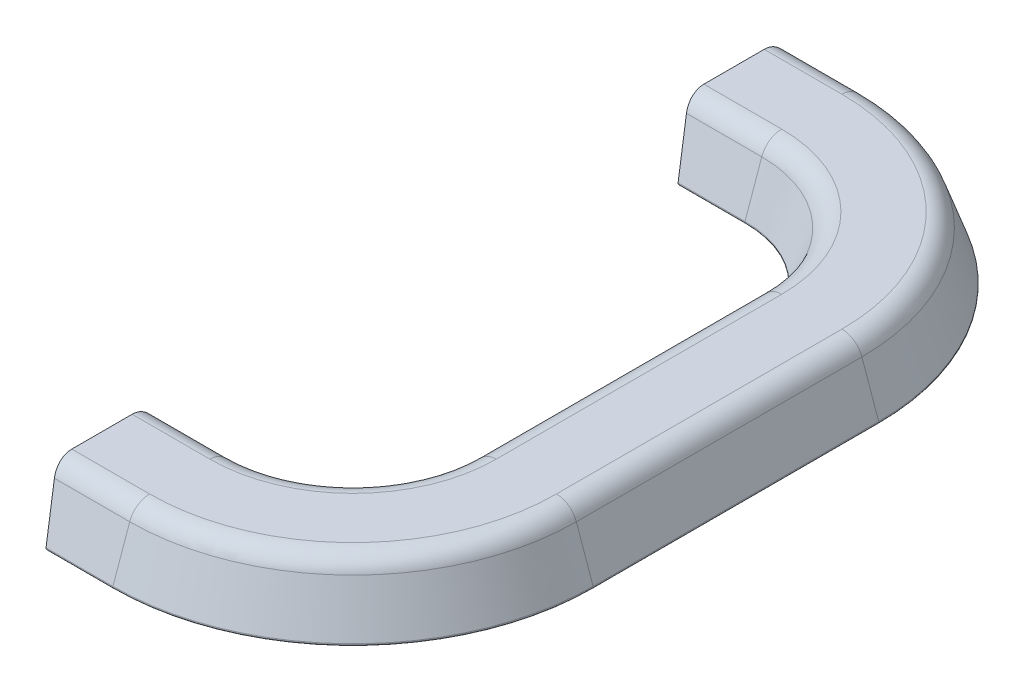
from build123d import *

# Parameters (mm, degrees)
FILLET1_R      = 5.08
SHELL1_T       = -2.54
EXTRUDE1_REACH = 121.17
FILLET2_R      = 0.396875


with BuildPart() as part:
    # Sweep1: sweep along a path in Sketch2
    with BuildLine(Plane(origin=(0, 0, 0), x_dir=(1, 0, 0), z_dir=(0, 1, 0))) as sweep1_path:
        Line((0, -59.724007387), (18.701415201, -59.724007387))
        ThreePointArc((18.701415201, -59.724007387), (36.661927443, -52.284519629), (44.101415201, -34.324007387))
        Line((44.101415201, -34.324007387), (44.101415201, 34.324007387))
        ThreePointArc((44.101415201, 34.324007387), (36.661927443, 52.284519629), (18.701415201, 59.724007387))
        Line((18.701415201, 59.724007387), (0, 59.724007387))
    # Sketch1 → Sweep1 (sweep)
    with BuildSketch(Plane(origin=(0, 0, 0), x_dir=(0, 0, -1), z_dir=(1, 0, 0))):
        Polygon((-92.230378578, 0), (-59.724007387, 0), (-65.134510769, 15.350234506), (-86.819875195, 15.350234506), align=None)
    sweep(path=sweep1_path.line)

    # SurfaceCut1
    split(bisect_by=Plane(origin=(2.625044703, 0.462866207, 0), x_dir=(0, 0, 1), z_dir=(-0.9848077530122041, -0.17364817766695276, 0)), keep=Keep.BOTTOM)

    # Fillet1
    fillet1_edges = [part.edges().sort_by_distance(p)[0] for p in [
        (55.821599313, 15.350234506, 71.444191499),
        (40.487731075, 15.350234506, 56.11032326),
        (71.19728301, 15.350234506, 0),
        (49.511918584, 15.350234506, 0),
        (55.821599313, 15.350234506, -71.444191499),
        (40.487731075, 15.350234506, -56.11032326),
        (9.350707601, 15.350234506, -86.819875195),
        (9.350707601, 15.350234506, -65.134510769),
        (9.350707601, 15.350234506, 86.819875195),
        (9.350707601, 15.350234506, 65.134510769),
    ]]
    fillet(fillet1_edges, radius=FILLET1_R)

    # Shell1
    shell1_openings = [part.faces().sort_by_distance(p)[0] for p in [
        (45.698397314, 0, 0),
        (1.458578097, 7.07822706, -75.977192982),
        (1.458578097, 7.07822706, 75.977192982),
    ]]
    offset(amount=SHELL1_T, openings=shell1_openings, kind=Kind.INTERSECTION)

    # Sketch4 → Extrude1 (add, up to next)
    with BuildSketch(Plane(origin=(2.625044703, 0.462866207, 0), x_dir=(0, 0, 1), z_dir=(-0.9848077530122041, -0.1736481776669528, 0)), mode=Mode.PRIVATE) as extrude1_sk1:
        with BuildLine():
            Line((-78.948196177, 12.537846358), (-78.59959728, 8.553342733))
            ThreePointArc((-78.59959728, 8.553342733), (-75.977192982, 6.150351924), (-73.354788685, 8.553342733))
            Line((-73.354788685, 8.553342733), (-73.006189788, 12.537846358))
            Line((-73.006189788, 12.537846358), (-78.948196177, 12.537846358))
        make_face()
    extrude1_tool1 = extrude(extrude1_sk1.sketch, amount=-EXTRUDE1_REACH, mode=Mode.PRIVATE) - part.part
    extrude1 = extrude1_tool1.solids().sort_by_distance((0.946808, 9.980618, -75.977193))[0]
    add(extrude1)

    # Sketch5 → 7_64 _0.10938_ Diameter Hole1 (revolve, cut)
    with BuildSketch(Plane(origin=(1.099932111, 9.112209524, -75.977192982), x_dir=(0.1736481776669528, -0.9848077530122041, 0), z_dir=(0, 0, 1))):
        Polygon((0, 0), (0, 13.534671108), (1.389126, 12.7), (1.389126, 0), align=None)
    f_7_64_0_10938_diameter_hole1 = revolve(axis=Axis((-5.153597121, 8.009543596, -75.977192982), (0.9848077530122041, 0.1736481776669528, 0)), mode=Mode.SUBTRACT)

    # Mirror1: Extrude1, 7_64 _0.10938_ Diameter Hole1 across plane
    add(extrude1.mirror(Plane.XY))
    add(f_7_64_0_10938_diameter_hole1.mirror(Plane.XY), mode=Mode.SUBTRACT)

    # Fillet2
    fillet2_edges = [part.edges().sort_by_distance(p)[0] for p in [
        (36.661927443, 0, 52.284519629),
        (59.647402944, 0, 75.26999513),
        (11.920791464, 12.810234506, -78.773896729),
        (11.920791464, 12.810234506, -73.180489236),
        (37.231090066, 12.810234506, -76.005795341),
        (11.920791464, 12.810234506, 78.773896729),
        (37.231090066, 12.810234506, 76.005795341),
        (11.920791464, 12.810234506, 73.180489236),
        (44.101415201, 0, 0),
        (76.607786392, 0, 0),
        (36.661927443, 0, -52.284519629),
        (59.647402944, 0, -75.26999513),
        (10.704037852, 0, -59.724007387),
        (10.704037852, 0, -92.230378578),
        (10.704037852, 0, 59.724007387),
        (10.704037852, 0, 92.230378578),
    ]]
    fillet(fillet2_edges, radius=FILLET2_R)


solid = part.part
